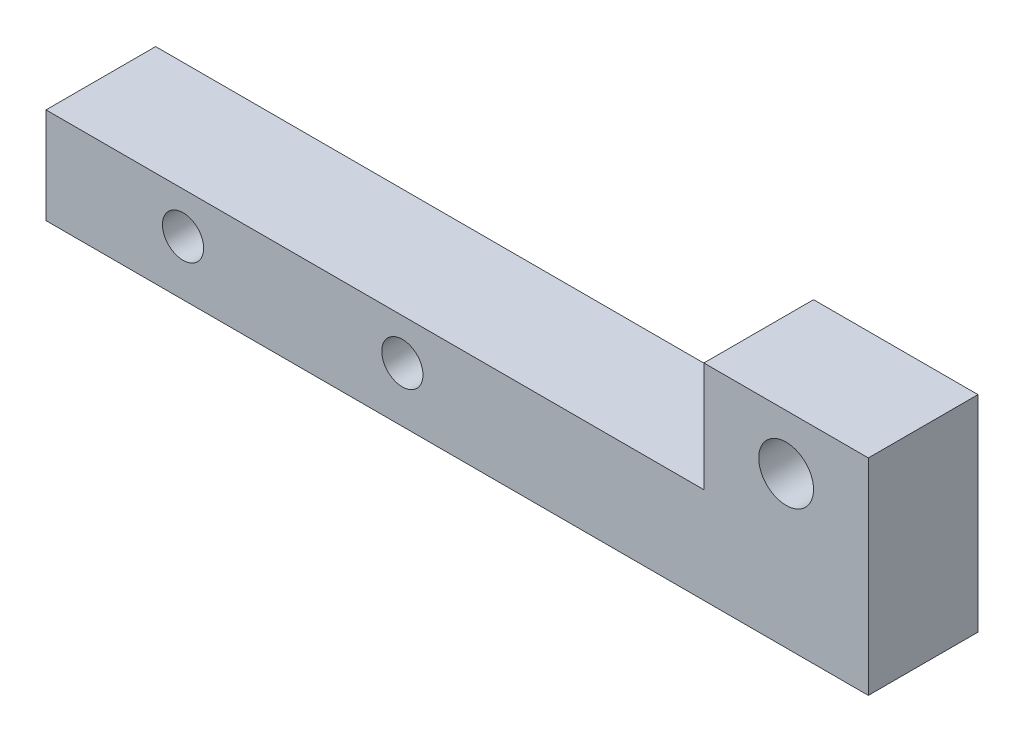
from build123d import *

# Parameters (mm, degrees)
SKETCH2_R           = 2.3876
SKETCH2_R_2         = 3.175
BOSS_EXTRUDE1_DEPTH = 12.7
CUT_EXTRUDE1_START  = 4.7752
SKETCH3_R           = 3.9624
CUT_EXTRUDE1_DEPTH  = 9.525


with BuildPart() as part:
    # Sketch2 → Boss-Extrude1 (new body)
    with BuildSketch(Plane.XY):
        Polygon((-15.875, -6.35), (79.375, -6.35), (79.375, 17.4752), (60.325, 17.4752), (60.325, 4.7625), (-15.875, 4.7625), align=None)
        with Locations((25.4, 0)):
            Circle(SKETCH2_R, mode=Mode.SUBTRACT)
        Circle(SKETCH2_R, mode=Mode.SUBTRACT)
        with Locations((69.85, 11.1252)):
            Circle(SKETCH2_R_2, mode=Mode.SUBTRACT)
    extrude(amount=BOSS_EXTRUDE1_DEPTH)

    # Sketch3 → Cut-Extrude1 (cut)
    with BuildSketch(Plane.XY.offset(CUT_EXTRUDE1_START)):
        Circle(SKETCH3_R)
        with Locations((25.4, 0)):
            Circle(SKETCH3_R)
    extrude(amount=-CUT_EXTRUDE1_DEPTH, mode=Mode.SUBTRACT)


solid = part.part
